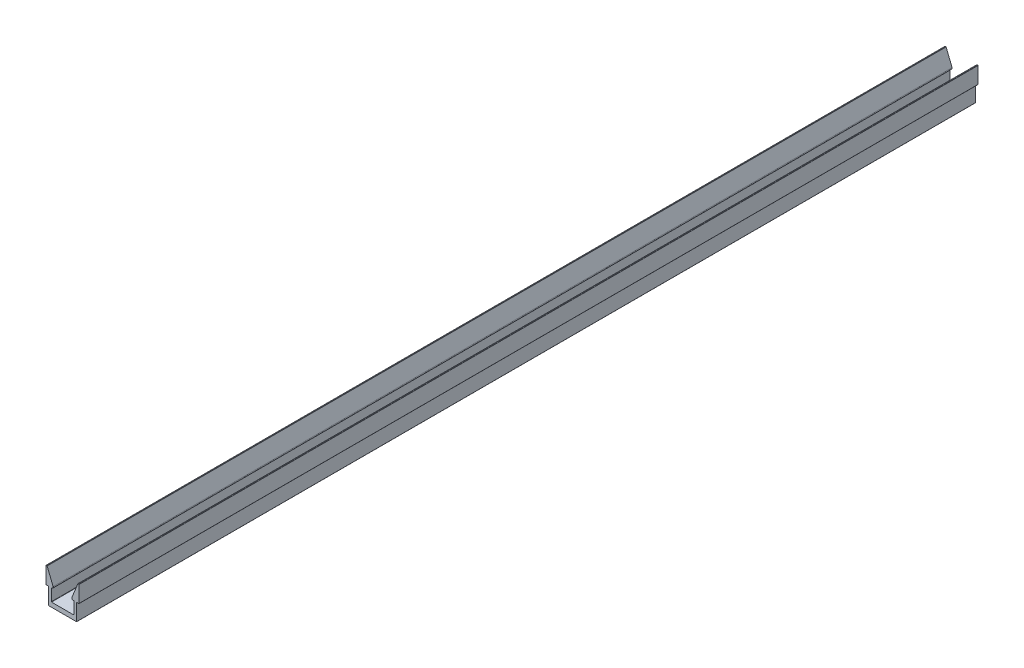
ISO-10303-21;
HEADER;
FILE_DESCRIPTION(('STEP AP214'),'2;1');
FILE_NAME('part.step','',(''),(''),'','','');
FILE_SCHEMA(('AUTOMOTIVE_DESIGN { 1 0 10303 214 1 1 1 1 }'));
ENDSEC;
DATA;
#1=APPLICATION_CONTEXT('core data for automotive mechanical design processes');
#2=APPLICATION_PROTOCOL_DEFINITION('international standard','automotive_design',2000,#1);
#3=PRODUCT_CONTEXT('',#1,'mechanical');
#4=PRODUCT('Part','Part','',(#3));
#5=PRODUCT_RELATED_PRODUCT_CATEGORY('part','',(#4));
#6=PRODUCT_DEFINITION_FORMATION('','',#4);
#7=PRODUCT_DEFINITION_CONTEXT('part definition',#1,'design');
#8=PRODUCT_DEFINITION('design','',#6,#7);
#9=PRODUCT_DEFINITION_SHAPE('','',#8);
#10=(LENGTH_UNIT() NAMED_UNIT(*) SI_UNIT(.MILLI.,.METRE.));
#11=(NAMED_UNIT(*) PLANE_ANGLE_UNIT() SI_UNIT($,.RADIAN.));
#12=(NAMED_UNIT(*) SI_UNIT($,.STERADIAN.) SOLID_ANGLE_UNIT());
#13=UNCERTAINTY_MEASURE_WITH_UNIT(LENGTH_MEASURE(1.E-05),#10,'distance_accuracy_value','');
#14=(GEOMETRIC_REPRESENTATION_CONTEXT(3) GLOBAL_UNCERTAINTY_ASSIGNED_CONTEXT((#13)) GLOBAL_UNIT_ASSIGNED_CONTEXT((#10,
#11,#12)) REPRESENTATION_CONTEXT('',''));
#15=CARTESIAN_POINT('',(0.,0.,0.));
#16=DIRECTION('',(0.,0.,1.));
#17=DIRECTION('',(1.,0.,0.));
#18=AXIS2_PLACEMENT_3D('',#15,#16,#17);
#19=CARTESIAN_POINT('',(6.35,9.525,508.));
#20=DIRECTION('',(1.,0.,0.));
#21=DIRECTION('',(0.,1.,0.));
#22=AXIS2_PLACEMENT_3D('',#19,#20,#21);
#23=PLANE('',#22);
#24=DIRECTION('',(0.,-1.,0.));
#25=VECTOR('',#24,1.);
#26=CARTESIAN_POINT('',(6.35,9.525,0.));
#27=LINE('',#26,#25);
#28=CARTESIAN_POINT('',(6.35,9.525,0.));
#29=VERTEX_POINT('',#28);
#30=CARTESIAN_POINT('',(6.35,2.667,0.));
#31=VERTEX_POINT('',#30);
#32=EDGE_CURVE('E214',#29,#31,#27,.T.);
#33=ORIENTED_EDGE('',*,*,#32,.T.);
#34=DIRECTION('',(0.,0.,-1.));
#35=VECTOR('',#34,1.);
#36=CARTESIAN_POINT('',(6.35,2.667,508.));
#37=LINE('',#36,#35);
#38=CARTESIAN_POINT('',(6.35,2.667,508.));
#39=VERTEX_POINT('',#38);
#40=EDGE_CURVE('E9',#39,#31,#37,.T.);
#41=ORIENTED_EDGE('',*,*,#40,.F.);
#42=DIRECTION('',(0.,-1.,0.));
#43=VECTOR('',#42,1.);
#44=CARTESIAN_POINT('',(6.35,9.525,508.));
#45=LINE('',#44,#43);
#46=CARTESIAN_POINT('',(6.35,9.525,508.));
#47=VERTEX_POINT('',#46);
#48=EDGE_CURVE('E285',#47,#39,#45,.T.);
#49=ORIENTED_EDGE('',*,*,#48,.F.);
#50=DIRECTION('',(0.,0.,-1.));
#51=VECTOR('',#50,1.);
#52=CARTESIAN_POINT('',(6.35,9.525,508.));
#53=LINE('',#52,#51);
#54=EDGE_CURVE('E227',#47,#29,#53,.T.);
#55=ORIENTED_EDGE('',*,*,#54,.T.);
#56=EDGE_LOOP('',(#33,#41,#49,#55));
#57=FACE_BOUND('',#56,.T.);
#58=ADVANCED_FACE('F14',(#57),#23,.F.);
#59=CARTESIAN_POINT('',(6.223,2.667,508.));
#60=DIRECTION('',(0.,0.,-1.));
#61=DIRECTION('',(-1.,0.,0.));
#62=AXIS2_PLACEMENT_3D('',#59,#60,#61);
#63=CYLINDRICAL_SURFACE('',#62,0.127);
#64=CARTESIAN_POINT('',(6.223,2.667,0.));
#65=DIRECTION('',(0.,0.,-1.));
#66=DIRECTION('',(-1.,0.,0.));
#67=AXIS2_PLACEMENT_3D('',#64,#65,#66);
#68=CIRCLE('',#67,0.127);
#69=CARTESIAN_POINT('',(6.223,2.54,0.));
#70=VERTEX_POINT('',#69);
#71=EDGE_CURVE('E210',#31,#70,#68,.T.);
#72=ORIENTED_EDGE('',*,*,#71,.T.);
#73=DIRECTION('',(0.,0.,-1.));
#74=VECTOR('',#73,1.);
#75=CARTESIAN_POINT('',(6.223,2.54,508.));
#76=LINE('',#75,#74);
#77=CARTESIAN_POINT('',(6.223,2.54,508.));
#78=VERTEX_POINT('',#77);
#79=EDGE_CURVE('E21',#78,#70,#76,.T.);
#80=ORIENTED_EDGE('',*,*,#79,.F.);
#81=CARTESIAN_POINT('',(6.223,2.667,508.));
#82=DIRECTION('',(0.,0.,-1.));
#83=DIRECTION('',(-1.,0.,0.));
#84=AXIS2_PLACEMENT_3D('',#81,#82,#83);
#85=CIRCLE('',#84,0.127);
#86=EDGE_CURVE('E223',#39,#78,#85,.T.);
#87=ORIENTED_EDGE('',*,*,#86,.F.);
#88=ORIENTED_EDGE('',*,*,#40,.T.);
#89=EDGE_LOOP('',(#72,#80,#87,#88));
#90=FACE_BOUND('',#89,.T.);
#91=ADVANCED_FACE('F222',(#90),#63,.F.);
#92=CARTESIAN_POINT('',(6.223,2.54,508.));
#93=DIRECTION('',(0.,-1.,0.));
#94=DIRECTION('',(1.,0.,0.));
#95=AXIS2_PLACEMENT_3D('',#92,#93,#94);
#96=PLANE('',#95);
#97=DIRECTION('',(-1.,0.,0.));
#98=VECTOR('',#97,1.);
#99=CARTESIAN_POINT('',(6.223,2.54,0.));
#100=LINE('',#99,#98);
#101=CARTESIAN_POINT('',(-6.223,2.54,0.));
#102=VERTEX_POINT('',#101);
#103=EDGE_CURVE('E216',#70,#102,#100,.T.);
#104=ORIENTED_EDGE('',*,*,#103,.T.);
#105=DIRECTION('',(0.,0.,-1.));
#106=VECTOR('',#105,1.);
#107=CARTESIAN_POINT('',(-6.223,2.54,508.));
#108=LINE('',#107,#106);
#109=CARTESIAN_POINT('',(-6.223,2.54,508.));
#110=VERTEX_POINT('',#109);
#111=EDGE_CURVE('E421',#110,#102,#108,.T.);
#112=ORIENTED_EDGE('',*,*,#111,.F.);
#113=DIRECTION('',(-1.,0.,0.));
#114=VECTOR('',#113,1.);
#115=CARTESIAN_POINT('',(6.223,2.54,508.));
#116=LINE('',#115,#114);
#117=EDGE_CURVE('E288',#78,#110,#116,.T.);
#118=ORIENTED_EDGE('',*,*,#117,.F.);
#119=ORIENTED_EDGE('',*,*,#79,.T.);
#120=EDGE_LOOP('',(#104,#112,#118,#119));
#121=FACE_BOUND('',#120,.T.);
#122=ADVANCED_FACE('F425',(#121),#96,.F.);
#123=CARTESIAN_POINT('',(-6.223,2.667,508.));
#124=DIRECTION('',(0.,0.,-1.));
#125=DIRECTION('',(-1.,0.,0.));
#126=AXIS2_PLACEMENT_3D('',#123,#124,#125);
#127=CYLINDRICAL_SURFACE('',#126,0.127);
#128=CARTESIAN_POINT('',(-6.223,2.667,0.));
#129=DIRECTION('',(0.,0.,-1.));
#130=DIRECTION('',(1.,0.,0.));
#131=AXIS2_PLACEMENT_3D('',#128,#129,#130);
#132=CIRCLE('',#131,0.127);
#133=CARTESIAN_POINT('',(-6.35,2.667,0.));
#134=VERTEX_POINT('',#133);
#135=EDGE_CURVE('E231',#102,#134,#132,.T.);
#136=ORIENTED_EDGE('',*,*,#135,.T.);
#137=DIRECTION('',(0.,0.,-1.));
#138=VECTOR('',#137,1.);
#139=CARTESIAN_POINT('',(-6.35,2.667,508.));
#140=LINE('',#139,#138);
#141=CARTESIAN_POINT('',(-6.35,2.667,508.));
#142=VERTEX_POINT('',#141);
#143=EDGE_CURVE('E418',#142,#134,#140,.T.);
#144=ORIENTED_EDGE('',*,*,#143,.F.);
#145=CARTESIAN_POINT('',(-6.223,2.667,508.));
#146=DIRECTION('',(0.,0.,-1.));
#147=DIRECTION('',(1.,0.,0.));
#148=AXIS2_PLACEMENT_3D('',#145,#146,#147);
#149=CIRCLE('',#148,0.127);
#150=EDGE_CURVE('E290',#110,#142,#149,.T.);
#151=ORIENTED_EDGE('',*,*,#150,.F.);
#152=ORIENTED_EDGE('',*,*,#111,.T.);
#153=EDGE_LOOP('',(#136,#144,#151,#152));
#154=FACE_BOUND('',#153,.T.);
#155=ADVANCED_FACE('F433',(#154),#127,.F.);
#156=CARTESIAN_POINT('',(-6.35,9.525,508.));
#157=DIRECTION('',(-1.,0.,0.));
#158=DIRECTION('',(0.,-1.,0.));
#159=AXIS2_PLACEMENT_3D('',#156,#157,#158);
#160=PLANE('',#159);
#161=DIRECTION('',(0.,1.,0.));
#162=VECTOR('',#161,1.);
#163=CARTESIAN_POINT('',(-6.35,9.525,0.));
#164=LINE('',#163,#162);
#165=CARTESIAN_POINT('',(-6.35,9.525,0.));
#166=VERTEX_POINT('',#165);
#167=EDGE_CURVE('E233',#134,#166,#164,.T.);
#168=ORIENTED_EDGE('',*,*,#167,.T.);
#169=DIRECTION('',(0.,0.,-1.));
#170=VECTOR('',#169,1.);
#171=CARTESIAN_POINT('',(-6.35,9.525,508.));
#172=LINE('',#171,#170);
#173=CARTESIAN_POINT('',(-6.35,9.525,508.));
#174=VERTEX_POINT('',#173);
#175=EDGE_CURVE('E415',#174,#166,#172,.T.);
#176=ORIENTED_EDGE('',*,*,#175,.F.);
#177=DIRECTION('',(0.,1.,0.));
#178=VECTOR('',#177,1.);
#179=CARTESIAN_POINT('',(-6.35,9.525,508.));
#180=LINE('',#179,#178);
#181=EDGE_CURVE('E292',#142,#174,#180,.T.);
#182=ORIENTED_EDGE('',*,*,#181,.F.);
#183=ORIENTED_EDGE('',*,*,#143,.T.);
#184=EDGE_LOOP('',(#168,#176,#182,#183));
#185=FACE_BOUND('',#184,.T.);
#186=ADVANCED_FACE('F436',(#185),#160,.F.);
#187=CARTESIAN_POINT('',(-6.00626165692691,9.525,508.));
#188=DIRECTION('',(0.,1.,0.));
#189=DIRECTION('',(0.,0.,1.));
#190=AXIS2_PLACEMENT_3D('',#187,#188,#189);
#191=PLANE('',#190);
#192=DIRECTION('',(1.,0.,0.));
#193=VECTOR('',#192,1.);
#194=CARTESIAN_POINT('',(-6.00626165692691,9.525,0.));
#195=LINE('',#194,#193);
#196=CARTESIAN_POINT('',(-6.00626165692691,9.525,0.));
#197=VERTEX_POINT('',#196);
#198=EDGE_CURVE('E235',#166,#197,#195,.T.);
#199=ORIENTED_EDGE('',*,*,#198,.T.);
#200=DIRECTION('',(0.,0.,-1.));
#201=VECTOR('',#200,1.);
#202=CARTESIAN_POINT('',(-6.00626165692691,9.525,508.));
#203=LINE('',#202,#201);
#204=CARTESIAN_POINT('',(-6.00626165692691,9.525,508.));
#205=VERTEX_POINT('',#204);
#206=EDGE_CURVE('E412',#205,#197,#203,.T.);
#207=ORIENTED_EDGE('',*,*,#206,.F.);
#208=DIRECTION('',(1.,0.,0.));
#209=VECTOR('',#208,1.);
#210=CARTESIAN_POINT('',(-6.00626165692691,9.525,508.));
#211=LINE('',#210,#209);
#212=EDGE_CURVE('E294',#174,#205,#211,.T.);
#213=ORIENTED_EDGE('',*,*,#212,.F.);
#214=ORIENTED_EDGE('',*,*,#175,.T.);
#215=EDGE_LOOP('',(#199,#207,#213,#214));
#216=FACE_BOUND('',#215,.T.);
#217=ADVANCED_FACE('F441',(#216),#191,.F.);
#218=CARTESIAN_POINT('',(-6.00626165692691,10.287,508.));
#219=DIRECTION('',(0.,0.,-1.));
#220=DIRECTION('',(-1.,0.,0.));
#221=AXIS2_PLACEMENT_3D('',#218,#219,#220);
#222=CYLINDRICAL_SURFACE('',#221,0.762);
#223=CARTESIAN_POINT('',(-6.00626165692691,10.287,0.));
#224=DIRECTION('',(0.,0.,1.));
#225=DIRECTION('',(-1.,0.,0.));
#226=AXIS2_PLACEMENT_3D('',#223,#224,#225);
#227=CIRCLE('',#226,0.762);
#228=CARTESIAN_POINT('',(-5.29974755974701,10.5724502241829,0.));
#229=VERTEX_POINT('',#228);
#230=EDGE_CURVE('E237',#197,#229,#227,.T.);
#231=ORIENTED_EDGE('',*,*,#230,.T.);
#232=DIRECTION('',(0.,0.,-1.));
#233=VECTOR('',#232,1.);
#234=CARTESIAN_POINT('',(-5.29974755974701,10.5724502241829,508.));
#235=LINE('',#234,#233);
#236=CARTESIAN_POINT('',(-5.29974755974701,10.5724502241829,508.));
#237=VERTEX_POINT('',#236);
#238=EDGE_CURVE('E409',#237,#229,#235,.T.);
#239=ORIENTED_EDGE('',*,*,#238,.F.);
#240=CARTESIAN_POINT('',(-6.00626165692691,10.287,508.));
#241=DIRECTION('',(0.,0.,1.));
#242=DIRECTION('',(-1.,0.,0.));
#243=AXIS2_PLACEMENT_3D('',#240,#241,#242);
#244=CIRCLE('',#243,0.762);
#245=EDGE_CURVE('E296',#205,#237,#244,.T.);
#246=ORIENTED_EDGE('',*,*,#245,.F.);
#247=ORIENTED_EDGE('',*,*,#206,.T.);
#248=EDGE_LOOP('',(#231,#239,#246,#247));
#249=FACE_BOUND('',#248,.T.);
#250=ADVANCED_FACE('F447',(#249),#222,.T.);
#251=CARTESIAN_POINT('',(-8.69281023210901,18.9705750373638,508.));
#252=DIRECTION('',(-0.92718385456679,-0.374606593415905,0.));
#253=DIRECTION('',(0.374606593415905,-0.92718385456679,0.));
#254=AXIS2_PLACEMENT_3D('',#251,#252,#253);
#255=PLANE('',#254);
#256=DIRECTION('',(-0.374606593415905,0.92718385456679,0.));
#257=VECTOR('',#256,1.);
#258=CARTESIAN_POINT('',(-8.69281023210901,18.9705750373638,0.));
#259=LINE('',#258,#257);
#260=CARTESIAN_POINT('',(-8.69281023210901,18.9705750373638,0.));
#261=VERTEX_POINT('',#260);
#262=EDGE_CURVE('E239',#229,#261,#259,.T.);
#263=ORIENTED_EDGE('',*,*,#262,.T.);
#264=DIRECTION('',(0.,0.,-1.));
#265=VECTOR('',#264,1.);
#266=CARTESIAN_POINT('',(-8.69281023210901,18.9705750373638,508.));
#267=LINE('',#266,#265);
#268=CARTESIAN_POINT('',(-8.69281023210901,18.9705750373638,508.));
#269=VERTEX_POINT('',#268);
#270=EDGE_CURVE('E406',#269,#261,#267,.T.);
#271=ORIENTED_EDGE('',*,*,#270,.F.);
#272=DIRECTION('',(-0.374606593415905,0.92718385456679,0.));
#273=VECTOR('',#272,1.);
#274=CARTESIAN_POINT('',(-8.69281023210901,18.9705750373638,508.));
#275=LINE('',#274,#273);
#276=EDGE_CURVE('E298',#237,#269,#275,.T.);
#277=ORIENTED_EDGE('',*,*,#276,.F.);
#278=ORIENTED_EDGE('',*,*,#238,.T.);
#279=EDGE_LOOP('',(#263,#271,#277,#278));
#280=FACE_BOUND('',#279,.T.);
#281=ADVANCED_FACE('F451',(#280),#255,.F.);
#282=CARTESIAN_POINT('',(-8.81056258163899,18.923,508.));
#283=DIRECTION('',(0.,0.,-1.));
#284=DIRECTION('',(-1.,0.,0.));
#285=AXIS2_PLACEMENT_3D('',#282,#283,#284);
#286=CYLINDRICAL_SURFACE('',#285,0.126999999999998);
#287=CARTESIAN_POINT('',(-8.81056258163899,18.923,0.));
#288=DIRECTION('',(0.,0.,1.));
#289=DIRECTION('',(-1.,0.,0.));
#290=AXIS2_PLACEMENT_3D('',#287,#288,#289);
#291=CIRCLE('',#290,0.126999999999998);
#292=CARTESIAN_POINT('',(-8.81056258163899,19.05,0.));
#293=VERTEX_POINT('',#292);
#294=EDGE_CURVE('E241',#261,#293,#291,.T.);
#295=ORIENTED_EDGE('',*,*,#294,.T.);
#296=DIRECTION('',(0.,0.,-1.));
#297=VECTOR('',#296,1.);
#298=CARTESIAN_POINT('',(-8.81056258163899,19.05,508.));
#299=LINE('',#298,#297);
#300=CARTESIAN_POINT('',(-8.81056258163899,19.05,508.));
#301=VERTEX_POINT('',#300);
#302=EDGE_CURVE('E403',#301,#293,#299,.T.);
#303=ORIENTED_EDGE('',*,*,#302,.F.);
#304=CARTESIAN_POINT('',(-8.81056258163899,18.923,508.));
#305=DIRECTION('',(0.,0.,1.));
#306=DIRECTION('',(-1.,0.,0.));
#307=AXIS2_PLACEMENT_3D('',#304,#305,#306);
#308=CIRCLE('',#307,0.126999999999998);
#309=EDGE_CURVE('E300',#269,#301,#308,.T.);
#310=ORIENTED_EDGE('',*,*,#309,.F.);
#311=ORIENTED_EDGE('',*,*,#270,.T.);
#312=EDGE_LOOP('',(#295,#303,#310,#311));
#313=FACE_BOUND('',#312,.T.);
#314=ADVANCED_FACE('F456',(#313),#286,.T.);
#315=CARTESIAN_POINT('',(-9.2075,19.05,508.));
#316=DIRECTION('',(0.,-1.,0.));
#317=DIRECTION('',(0.,0.,-1.));
#318=AXIS2_PLACEMENT_3D('',#315,#316,#317);
#319=PLANE('',#318);
#320=DIRECTION('',(-1.,0.,0.));
#321=VECTOR('',#320,1.);
#322=CARTESIAN_POINT('',(-9.2075,19.05,0.));
#323=LINE('',#322,#321);
#324=CARTESIAN_POINT('',(-9.2075,19.05,0.));
#325=VERTEX_POINT('',#324);
#326=EDGE_CURVE('E243',#293,#325,#323,.T.);
#327=ORIENTED_EDGE('',*,*,#326,.T.);
#328=DIRECTION('',(0.,0.,-1.));
#329=VECTOR('',#328,1.);
#330=CARTESIAN_POINT('',(-9.2075,19.05,508.));
#331=LINE('',#330,#329);
#332=CARTESIAN_POINT('',(-9.2075,19.05,508.));
#333=VERTEX_POINT('',#332);
#334=EDGE_CURVE('E400',#333,#325,#331,.T.);
#335=ORIENTED_EDGE('',*,*,#334,.F.);
#336=DIRECTION('',(-1.,0.,0.));
#337=VECTOR('',#336,1.);
#338=CARTESIAN_POINT('',(-9.2075,19.05,508.));
#339=LINE('',#338,#337);
#340=EDGE_CURVE('E302',#301,#333,#339,.T.);
#341=ORIENTED_EDGE('',*,*,#340,.F.);
#342=ORIENTED_EDGE('',*,*,#302,.T.);
#343=EDGE_LOOP('',(#327,#335,#341,#342));
#344=FACE_BOUND('',#343,.T.);
#345=ADVANCED_FACE('F462',(#344),#319,.F.);
#346=CARTESIAN_POINT('',(-9.2075,18.923,508.));
#347=DIRECTION('',(0.,0.,-1.));
#348=DIRECTION('',(-1.,0.,0.));
#349=AXIS2_PLACEMENT_3D('',#346,#347,#348);
#350=CYLINDRICAL_SURFACE('',#349,0.126999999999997);
#351=CARTESIAN_POINT('',(-9.2075,18.923,0.));
#352=DIRECTION('',(0.,0.,1.));
#353=DIRECTION('',(-1.,0.,0.));
#354=AXIS2_PLACEMENT_3D('',#351,#352,#353);
#355=CIRCLE('',#354,0.126999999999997);
#356=CARTESIAN_POINT('',(-9.3345,18.923,0.));
#357=VERTEX_POINT('',#356);
#358=EDGE_CURVE('E245',#325,#357,#355,.T.);
#359=ORIENTED_EDGE('',*,*,#358,.T.);
#360=DIRECTION('',(0.,0.,-1.));
#361=VECTOR('',#360,1.);
#362=CARTESIAN_POINT('',(-9.3345,18.923,508.));
#363=LINE('',#362,#361);
#364=CARTESIAN_POINT('',(-9.3345,18.923,508.));
#365=VERTEX_POINT('',#364);
#366=EDGE_CURVE('E397',#365,#357,#363,.T.);
#367=ORIENTED_EDGE('',*,*,#366,.F.);
#368=CARTESIAN_POINT('',(-9.2075,18.923,508.));
#369=DIRECTION('',(0.,0.,1.));
#370=DIRECTION('',(-1.,0.,0.));
#371=AXIS2_PLACEMENT_3D('',#368,#369,#370);
#372=CIRCLE('',#371,0.126999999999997);
#373=EDGE_CURVE('E304',#333,#365,#372,.T.);
#374=ORIENTED_EDGE('',*,*,#373,.F.);
#375=ORIENTED_EDGE('',*,*,#334,.T.);
#376=EDGE_LOOP('',(#359,#367,#374,#375));
#377=FACE_BOUND('',#376,.T.);
#378=ADVANCED_FACE('F466',(#377),#350,.T.);
#379=CARTESIAN_POINT('',(-9.3345,9.652,508.));
#380=DIRECTION('',(1.,0.,0.));
#381=DIRECTION('',(0.,1.,0.));
#382=AXIS2_PLACEMENT_3D('',#379,#380,#381);
#383=PLANE('',#382);
#384=DIRECTION('',(0.,-1.,0.));
#385=VECTOR('',#384,1.);
#386=CARTESIAN_POINT('',(-9.3345,9.652,0.));
#387=LINE('',#386,#385);
#388=CARTESIAN_POINT('',(-9.3345,9.652,0.));
#389=VERTEX_POINT('',#388);
#390=EDGE_CURVE('E247',#357,#389,#387,.T.);
#391=ORIENTED_EDGE('',*,*,#390,.T.);
#392=DIRECTION('',(0.,0.,-1.));
#393=VECTOR('',#392,1.);
#394=CARTESIAN_POINT('',(-9.3345,9.652,508.));
#395=LINE('',#394,#393);
#396=CARTESIAN_POINT('',(-9.3345,9.652,508.));
#397=VERTEX_POINT('',#396);
#398=EDGE_CURVE('E394',#397,#389,#395,.T.);
#399=ORIENTED_EDGE('',*,*,#398,.F.);
#400=DIRECTION('',(0.,-1.,0.));
#401=VECTOR('',#400,1.);
#402=CARTESIAN_POINT('',(-9.3345,9.652,508.));
#403=LINE('',#402,#401);
#404=EDGE_CURVE('E306',#365,#397,#403,.T.);
#405=ORIENTED_EDGE('',*,*,#404,.F.);
#406=ORIENTED_EDGE('',*,*,#366,.T.);
#407=EDGE_LOOP('',(#391,#399,#405,#406));
#408=FACE_BOUND('',#407,.T.);
#409=ADVANCED_FACE('F471',(#408),#383,.F.);
#410=CARTESIAN_POINT('',(-9.2075,9.652,508.));
#411=DIRECTION('',(0.,0.,-1.));
#412=DIRECTION('',(-1.,0.,0.));
#413=AXIS2_PLACEMENT_3D('',#410,#411,#412);
#414=CYLINDRICAL_SURFACE('',#413,0.127);
#415=CARTESIAN_POINT('',(-9.2075,9.652,0.));
#416=DIRECTION('',(0.,0.,1.));
#417=DIRECTION('',(-1.,0.,0.));
#418=AXIS2_PLACEMENT_3D('',#415,#416,#417);
#419=CIRCLE('',#418,0.127);
#420=CARTESIAN_POINT('',(-9.2075,9.525,0.));
#421=VERTEX_POINT('',#420);
#422=EDGE_CURVE('E249',#389,#421,#419,.T.);
#423=ORIENTED_EDGE('',*,*,#422,.T.);
#424=DIRECTION('',(0.,0.,-1.));
#425=VECTOR('',#424,1.);
#426=CARTESIAN_POINT('',(-9.2075,9.525,508.));
#427=LINE('',#426,#425);
#428=CARTESIAN_POINT('',(-9.2075,9.525,508.));
#429=VERTEX_POINT('',#428);
#430=EDGE_CURVE('E391',#429,#421,#427,.T.);
#431=ORIENTED_EDGE('',*,*,#430,.F.);
#432=CARTESIAN_POINT('',(-9.2075,9.652,508.));
#433=DIRECTION('',(0.,0.,1.));
#434=DIRECTION('',(-1.,0.,0.));
#435=AXIS2_PLACEMENT_3D('',#432,#433,#434);
#436=CIRCLE('',#435,0.127);
#437=EDGE_CURVE('E308',#397,#429,#436,.T.);
#438=ORIENTED_EDGE('',*,*,#437,.F.);
#439=ORIENTED_EDGE('',*,*,#398,.T.);
#440=EDGE_LOOP('',(#423,#431,#438,#439));
#441=FACE_BOUND('',#440,.T.);
#442=ADVANCED_FACE('F477',(#441),#414,.T.);
#443=CARTESIAN_POINT('',(-8.1534,9.525,508.));
#444=DIRECTION('',(0.,1.,0.));
#445=DIRECTION('',(0.,0.,1.));
#446=AXIS2_PLACEMENT_3D('',#443,#444,#445);
#447=PLANE('',#446);
#448=DIRECTION('',(1.,0.,0.));
#449=VECTOR('',#448,1.);
#450=CARTESIAN_POINT('',(-8.1534,9.525,0.));
#451=LINE('',#450,#449);
#452=CARTESIAN_POINT('',(-8.1534,9.525,0.));
#453=VERTEX_POINT('',#452);
#454=EDGE_CURVE('E251',#421,#453,#451,.T.);
#455=ORIENTED_EDGE('',*,*,#454,.T.);
#456=DIRECTION('',(0.,0.,-1.));
#457=VECTOR('',#456,1.);
#458=CARTESIAN_POINT('',(-8.1534,9.525,508.));
#459=LINE('',#458,#457);
#460=CARTESIAN_POINT('',(-8.1534,9.525,508.));
#461=VERTEX_POINT('',#460);
#462=EDGE_CURVE('E388',#461,#453,#459,.T.);
#463=ORIENTED_EDGE('',*,*,#462,.F.);
#464=DIRECTION('',(1.,0.,0.));
#465=VECTOR('',#464,1.);
#466=CARTESIAN_POINT('',(-8.1534,9.525,508.));
#467=LINE('',#466,#465);
#468=EDGE_CURVE('E310',#429,#461,#467,.T.);
#469=ORIENTED_EDGE('',*,*,#468,.F.);
#470=ORIENTED_EDGE('',*,*,#430,.T.);
#471=EDGE_LOOP('',(#455,#463,#469,#470));
#472=FACE_BOUND('',#471,.T.);
#473=ADVANCED_FACE('F481',(#472),#447,.F.);
#474=CARTESIAN_POINT('',(-8.1534,9.398,508.));
#475=DIRECTION('',(0.,0.,-1.));
#476=DIRECTION('',(-1.,0.,0.));
#477=AXIS2_PLACEMENT_3D('',#474,#475,#476);
#478=CYLINDRICAL_SURFACE('',#477,0.127);
#479=CARTESIAN_POINT('',(-8.1534,9.398,0.));
#480=DIRECTION('',(0.,0.,-1.));
#481=DIRECTION('',(1.,0.,0.));
#482=AXIS2_PLACEMENT_3D('',#479,#480,#481);
#483=CIRCLE('',#482,0.127);
#484=CARTESIAN_POINT('',(-8.0264,9.398,0.));
#485=VERTEX_POINT('',#484);
#486=EDGE_CURVE('E253',#453,#485,#483,.T.);
#487=ORIENTED_EDGE('',*,*,#486,.T.);
#488=DIRECTION('',(0.,0.,-1.));
#489=VECTOR('',#488,1.);
#490=CARTESIAN_POINT('',(-8.0264,9.398,508.));
#491=LINE('',#490,#489);
#492=CARTESIAN_POINT('',(-8.0264,9.398,508.));
#493=VERTEX_POINT('',#492);
#494=EDGE_CURVE('E385',#493,#485,#491,.T.);
#495=ORIENTED_EDGE('',*,*,#494,.F.);
#496=CARTESIAN_POINT('',(-8.1534,9.398,508.));
#497=DIRECTION('',(0.,0.,-1.));
#498=DIRECTION('',(1.,0.,0.));
#499=AXIS2_PLACEMENT_3D('',#496,#497,#498);
#500=CIRCLE('',#499,0.127);
#501=EDGE_CURVE('E312',#461,#493,#500,.T.);
#502=ORIENTED_EDGE('',*,*,#501,.F.);
#503=ORIENTED_EDGE('',*,*,#462,.T.);
#504=EDGE_LOOP('',(#487,#495,#502,#503));
#505=FACE_BOUND('',#504,.T.);
#506=ADVANCED_FACE('F486',(#505),#478,.F.);
#507=CARTESIAN_POINT('',(-8.0264,0.127,508.));
#508=DIRECTION('',(1.,0.,0.));
#509=DIRECTION('',(0.,0.,-1.));
#510=AXIS2_PLACEMENT_3D('',#507,#508,#509);
#511=PLANE('',#510);
#512=DIRECTION('',(0.,-1.,0.));
#513=VECTOR('',#512,1.);
#514=CARTESIAN_POINT('',(-8.0264,0.127,0.));
#515=LINE('',#514,#513);
#516=CARTESIAN_POINT('',(-8.0264,0.127,0.));
#517=VERTEX_POINT('',#516);
#518=EDGE_CURVE('E255',#485,#517,#515,.T.);
#519=ORIENTED_EDGE('',*,*,#518,.T.);
#520=DIRECTION('',(0.,0.,-1.));
#521=VECTOR('',#520,1.);
#522=CARTESIAN_POINT('',(-8.0264,0.127,508.));
#523=LINE('',#522,#521);
#524=CARTESIAN_POINT('',(-8.0264,0.127,508.));
#525=VERTEX_POINT('',#524);
#526=EDGE_CURVE('E382',#525,#517,#523,.T.);
#527=ORIENTED_EDGE('',*,*,#526,.F.);
#528=DIRECTION('',(0.,-1.,0.));
#529=VECTOR('',#528,1.);
#530=CARTESIAN_POINT('',(-8.0264,0.127,508.));
#531=LINE('',#530,#529);
#532=EDGE_CURVE('E314',#493,#525,#531,.T.);
#533=ORIENTED_EDGE('',*,*,#532,.F.);
#534=ORIENTED_EDGE('',*,*,#494,.T.);
#535=EDGE_LOOP('',(#519,#527,#533,#534));
#536=FACE_BOUND('',#535,.T.);
#537=ADVANCED_FACE('F492',(#536),#511,.F.);
#538=CARTESIAN_POINT('',(-7.8994,0.127,508.));
#539=DIRECTION('',(0.,0.,-1.));
#540=DIRECTION('',(-1.,0.,0.));
#541=AXIS2_PLACEMENT_3D('',#538,#539,#540);
#542=CYLINDRICAL_SURFACE('',#541,0.127);
#543=CARTESIAN_POINT('',(-7.8994,0.127,0.));
#544=DIRECTION('',(0.,0.,1.));
#545=DIRECTION('',(-1.,0.,0.));
#546=AXIS2_PLACEMENT_3D('',#543,#544,#545);
#547=CIRCLE('',#546,0.127);
#548=CARTESIAN_POINT('',(-7.8994,0.,0.));
#549=VERTEX_POINT('',#548);
#550=EDGE_CURVE('E257',#517,#549,#547,.T.);
#551=ORIENTED_EDGE('',*,*,#550,.T.);
#552=DIRECTION('',(0.,0.,-1.));
#553=VECTOR('',#552,1.);
#554=CARTESIAN_POINT('',(-7.8994,0.,508.));
#555=LINE('',#554,#553);
#556=CARTESIAN_POINT('',(-7.8994,0.,508.));
#557=VERTEX_POINT('',#556);
#558=EDGE_CURVE('E379',#557,#549,#555,.T.);
#559=ORIENTED_EDGE('',*,*,#558,.F.);
#560=CARTESIAN_POINT('',(-7.8994,0.127,508.));
#561=DIRECTION('',(0.,0.,1.));
#562=DIRECTION('',(-1.,0.,0.));
#563=AXIS2_PLACEMENT_3D('',#560,#561,#562);
#564=CIRCLE('',#563,0.127);
#565=EDGE_CURVE('E316',#525,#557,#564,.T.);
#566=ORIENTED_EDGE('',*,*,#565,.F.);
#567=ORIENTED_EDGE('',*,*,#526,.T.);
#568=EDGE_LOOP('',(#551,#559,#566,#567));
#569=FACE_BOUND('',#568,.T.);
#570=ADVANCED_FACE('F496',(#569),#542,.T.);
#571=CARTESIAN_POINT('',(-7.8994,0.,508.));
#572=DIRECTION('',(0.,1.,0.));
#573=DIRECTION('',(0.,0.,1.));
#574=AXIS2_PLACEMENT_3D('',#571,#572,#573);
#575=PLANE('',#574);
#576=DIRECTION('',(1.,0.,0.));
#577=VECTOR('',#576,1.);
#578=CARTESIAN_POINT('',(-7.8994,0.,0.));
#579=LINE('',#578,#577);
#580=CARTESIAN_POINT('',(7.8994,0.,0.));
#581=VERTEX_POINT('',#580);
#582=EDGE_CURVE('E259',#549,#581,#579,.T.);
#583=ORIENTED_EDGE('',*,*,#582,.T.);
#584=DIRECTION('',(0.,0.,-1.));
#585=VECTOR('',#584,1.);
#586=CARTESIAN_POINT('',(7.8994,0.,508.));
#587=LINE('',#586,#585);
#588=CARTESIAN_POINT('',(7.8994,0.,508.));
#589=VERTEX_POINT('',#588);
#590=EDGE_CURVE('E376',#589,#581,#587,.T.);
#591=ORIENTED_EDGE('',*,*,#590,.F.);
#592=DIRECTION('',(1.,0.,0.));
#593=VECTOR('',#592,1.);
#594=CARTESIAN_POINT('',(-7.8994,0.,508.));
#595=LINE('',#594,#593);
#596=EDGE_CURVE('E318',#557,#589,#595,.T.);
#597=ORIENTED_EDGE('',*,*,#596,.F.);
#598=ORIENTED_EDGE('',*,*,#558,.T.);
#599=EDGE_LOOP('',(#583,#591,#597,#598));
#600=FACE_BOUND('',#599,.T.);
#601=ADVANCED_FACE('F501',(#600),#575,.F.);
#602=CARTESIAN_POINT('',(7.8994,0.127,508.));
#603=DIRECTION('',(0.,0.,-1.));
#604=DIRECTION('',(-1.,0.,0.));
#605=AXIS2_PLACEMENT_3D('',#602,#603,#604);
#606=CYLINDRICAL_SURFACE('',#605,0.127);
#607=CARTESIAN_POINT('',(7.8994,0.127,0.));
#608=DIRECTION('',(0.,0.,1.));
#609=DIRECTION('',(1.,0.,0.));
#610=AXIS2_PLACEMENT_3D('',#607,#608,#609);
#611=CIRCLE('',#610,0.127);
#612=CARTESIAN_POINT('',(8.0264,0.127,0.));
#613=VERTEX_POINT('',#612);
#614=EDGE_CURVE('E261',#581,#613,#611,.T.);
#615=ORIENTED_EDGE('',*,*,#614,.T.);
#616=DIRECTION('',(0.,0.,-1.));
#617=VECTOR('',#616,1.);
#618=CARTESIAN_POINT('',(8.0264,0.127,508.));
#619=LINE('',#618,#617);
#620=CARTESIAN_POINT('',(8.0264,0.127,508.));
#621=VERTEX_POINT('',#620);
#622=EDGE_CURVE('E373',#621,#613,#619,.T.);
#623=ORIENTED_EDGE('',*,*,#622,.F.);
#624=CARTESIAN_POINT('',(7.8994,0.127,508.));
#625=DIRECTION('',(0.,0.,1.));
#626=DIRECTION('',(1.,0.,0.));
#627=AXIS2_PLACEMENT_3D('',#624,#625,#626);
#628=CIRCLE('',#627,0.127);
#629=EDGE_CURVE('E320',#589,#621,#628,.T.);
#630=ORIENTED_EDGE('',*,*,#629,.F.);
#631=ORIENTED_EDGE('',*,*,#590,.T.);
#632=EDGE_LOOP('',(#615,#623,#630,#631));
#633=FACE_BOUND('',#632,.T.);
#634=ADVANCED_FACE('F507',(#633),#606,.T.);
#635=CARTESIAN_POINT('',(8.0264,0.127,508.));
#636=DIRECTION('',(-1.,0.,0.));
#637=DIRECTION('',(0.,0.,1.));
#638=AXIS2_PLACEMENT_3D('',#635,#636,#637);
#639=PLANE('',#638);
#640=DIRECTION('',(0.,1.,0.));
#641=VECTOR('',#640,1.);
#642=CARTESIAN_POINT('',(8.0264,0.127,0.));
#643=LINE('',#642,#641);
#644=CARTESIAN_POINT('',(8.0264,9.398,0.));
#645=VERTEX_POINT('',#644);
#646=EDGE_CURVE('E263',#613,#645,#643,.T.);
#647=ORIENTED_EDGE('',*,*,#646,.T.);
#648=DIRECTION('',(0.,0.,-1.));
#649=VECTOR('',#648,1.);
#650=CARTESIAN_POINT('',(8.0264,9.398,508.));
#651=LINE('',#650,#649);
#652=CARTESIAN_POINT('',(8.0264,9.398,508.));
#653=VERTEX_POINT('',#652);
#654=EDGE_CURVE('E370',#653,#645,#651,.T.);
#655=ORIENTED_EDGE('',*,*,#654,.F.);
#656=DIRECTION('',(0.,1.,0.));
#657=VECTOR('',#656,1.);
#658=CARTESIAN_POINT('',(8.0264,0.127,508.));
#659=LINE('',#658,#657);
#660=EDGE_CURVE('E322',#621,#653,#659,.T.);
#661=ORIENTED_EDGE('',*,*,#660,.F.);
#662=ORIENTED_EDGE('',*,*,#622,.T.);
#663=EDGE_LOOP('',(#647,#655,#661,#662));
#664=FACE_BOUND('',#663,.T.);
#665=ADVANCED_FACE('F511',(#664),#639,.F.);
#666=CARTESIAN_POINT('',(8.1534,9.398,508.));
#667=DIRECTION('',(0.,0.,-1.));
#668=DIRECTION('',(-1.,0.,0.));
#669=AXIS2_PLACEMENT_3D('',#666,#667,#668);
#670=CYLINDRICAL_SURFACE('',#669,0.127);
#671=CARTESIAN_POINT('',(8.1534,9.398,0.));
#672=DIRECTION('',(0.,0.,-1.));
#673=DIRECTION('',(-1.,0.,0.));
#674=AXIS2_PLACEMENT_3D('',#671,#672,#673);
#675=CIRCLE('',#674,0.127);
#676=CARTESIAN_POINT('',(8.1534,9.525,0.));
#677=VERTEX_POINT('',#676);
#678=EDGE_CURVE('E265',#645,#677,#675,.T.);
#679=ORIENTED_EDGE('',*,*,#678,.T.);
#680=DIRECTION('',(0.,0.,-1.));
#681=VECTOR('',#680,1.);
#682=CARTESIAN_POINT('',(8.1534,9.525,508.));
#683=LINE('',#682,#681);
#684=CARTESIAN_POINT('',(8.1534,9.525,508.));
#685=VERTEX_POINT('',#684);
#686=EDGE_CURVE('E367',#685,#677,#683,.T.);
#687=ORIENTED_EDGE('',*,*,#686,.F.);
#688=CARTESIAN_POINT('',(8.1534,9.398,508.));
#689=DIRECTION('',(0.,0.,-1.));
#690=DIRECTION('',(-1.,0.,0.));
#691=AXIS2_PLACEMENT_3D('',#688,#689,#690);
#692=CIRCLE('',#691,0.127);
#693=EDGE_CURVE('E324',#653,#685,#692,.T.);
#694=ORIENTED_EDGE('',*,*,#693,.F.);
#695=ORIENTED_EDGE('',*,*,#654,.T.);
#696=EDGE_LOOP('',(#679,#687,#694,#695));
#697=FACE_BOUND('',#696,.T.);
#698=ADVANCED_FACE('F516',(#697),#670,.F.);
#699=CARTESIAN_POINT('',(8.1534,9.525,508.));
#700=DIRECTION('',(0.,1.,0.));
#701=DIRECTION('',(0.,0.,1.));
#702=AXIS2_PLACEMENT_3D('',#699,#700,#701);
#703=PLANE('',#702);
#704=DIRECTION('',(1.,0.,0.));
#705=VECTOR('',#704,1.);
#706=CARTESIAN_POINT('',(8.1534,9.525,0.));
#707=LINE('',#706,#705);
#708=CARTESIAN_POINT('',(9.2075,9.525,0.));
#709=VERTEX_POINT('',#708);
#710=EDGE_CURVE('E267',#677,#709,#707,.T.);
#711=ORIENTED_EDGE('',*,*,#710,.T.);
#712=DIRECTION('',(0.,0.,-1.));
#713=VECTOR('',#712,1.);
#714=CARTESIAN_POINT('',(9.2075,9.525,508.));
#715=LINE('',#714,#713);
#716=CARTESIAN_POINT('',(9.2075,9.525,508.));
#717=VERTEX_POINT('',#716);
#718=EDGE_CURVE('E364',#717,#709,#715,.T.);
#719=ORIENTED_EDGE('',*,*,#718,.F.);
#720=DIRECTION('',(1.,0.,0.));
#721=VECTOR('',#720,1.);
#722=CARTESIAN_POINT('',(8.1534,9.525,508.));
#723=LINE('',#722,#721);
#724=EDGE_CURVE('E326',#685,#717,#723,.T.);
#725=ORIENTED_EDGE('',*,*,#724,.F.);
#726=ORIENTED_EDGE('',*,*,#686,.T.);
#727=EDGE_LOOP('',(#711,#719,#725,#726));
#728=FACE_BOUND('',#727,.T.);
#729=ADVANCED_FACE('F522',(#728),#703,.F.);
#730=CARTESIAN_POINT('',(9.2075,9.652,508.));
#731=DIRECTION('',(0.,0.,-1.));
#732=DIRECTION('',(-1.,0.,0.));
#733=AXIS2_PLACEMENT_3D('',#730,#731,#732);
#734=CYLINDRICAL_SURFACE('',#733,0.127);
#735=CARTESIAN_POINT('',(9.2075,9.652,0.));
#736=DIRECTION('',(0.,0.,1.));
#737=DIRECTION('',(1.,0.,0.));
#738=AXIS2_PLACEMENT_3D('',#735,#736,#737);
#739=CIRCLE('',#738,0.127);
#740=CARTESIAN_POINT('',(9.3345,9.652,0.));
#741=VERTEX_POINT('',#740);
#742=EDGE_CURVE('E269',#709,#741,#739,.T.);
#743=ORIENTED_EDGE('',*,*,#742,.T.);
#744=DIRECTION('',(0.,0.,-1.));
#745=VECTOR('',#744,1.);
#746=CARTESIAN_POINT('',(9.3345,9.652,508.));
#747=LINE('',#746,#745);
#748=CARTESIAN_POINT('',(9.3345,9.652,508.));
#749=VERTEX_POINT('',#748);
#750=EDGE_CURVE('E361',#749,#741,#747,.T.);
#751=ORIENTED_EDGE('',*,*,#750,.F.);
#752=CARTESIAN_POINT('',(9.2075,9.652,508.));
#753=DIRECTION('',(0.,0.,1.));
#754=DIRECTION('',(1.,0.,0.));
#755=AXIS2_PLACEMENT_3D('',#752,#753,#754);
#756=CIRCLE('',#755,0.127);
#757=EDGE_CURVE('E328',#717,#749,#756,.T.);
#758=ORIENTED_EDGE('',*,*,#757,.F.);
#759=ORIENTED_EDGE('',*,*,#718,.T.);
#760=EDGE_LOOP('',(#743,#751,#758,#759));
#761=FACE_BOUND('',#760,.T.);
#762=ADVANCED_FACE('F526',(#761),#734,.T.);
#763=CARTESIAN_POINT('',(9.3345,9.652,508.));
#764=DIRECTION('',(-1.,0.,0.));
#765=DIRECTION('',(0.,-1.,0.));
#766=AXIS2_PLACEMENT_3D('',#763,#764,#765);
#767=PLANE('',#766);
#768=DIRECTION('',(0.,1.,0.));
#769=VECTOR('',#768,1.);
#770=CARTESIAN_POINT('',(9.3345,9.652,0.));
#771=LINE('',#770,#769);
#772=CARTESIAN_POINT('',(9.3345,18.923,0.));
#773=VERTEX_POINT('',#772);
#774=EDGE_CURVE('E271',#741,#773,#771,.T.);
#775=ORIENTED_EDGE('',*,*,#774,.T.);
#776=DIRECTION('',(0.,0.,-1.));
#777=VECTOR('',#776,1.);
#778=CARTESIAN_POINT('',(9.3345,18.923,508.));
#779=LINE('',#778,#777);
#780=CARTESIAN_POINT('',(9.3345,18.923,508.));
#781=VERTEX_POINT('',#780);
#782=EDGE_CURVE('E358',#781,#773,#779,.T.);
#783=ORIENTED_EDGE('',*,*,#782,.F.);
#784=DIRECTION('',(0.,1.,0.));
#785=VECTOR('',#784,1.);
#786=CARTESIAN_POINT('',(9.3345,9.652,508.));
#787=LINE('',#786,#785);
#788=EDGE_CURVE('E330',#749,#781,#787,.T.);
#789=ORIENTED_EDGE('',*,*,#788,.F.);
#790=ORIENTED_EDGE('',*,*,#750,.T.);
#791=EDGE_LOOP('',(#775,#783,#789,#790));
#792=FACE_BOUND('',#791,.T.);
#793=ADVANCED_FACE('F531',(#792),#767,.F.);
#794=CARTESIAN_POINT('',(9.2075,18.923,508.));
#795=DIRECTION('',(0.,0.,-1.));
#796=DIRECTION('',(-1.,0.,0.));
#797=AXIS2_PLACEMENT_3D('',#794,#795,#796);
#798=CYLINDRICAL_SURFACE('',#797,0.126999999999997);
#799=CARTESIAN_POINT('',(9.2075,18.923,0.));
#800=DIRECTION('',(0.,0.,1.));
#801=DIRECTION('',(1.,0.,0.));
#802=AXIS2_PLACEMENT_3D('',#799,#800,#801);
#803=CIRCLE('',#802,0.126999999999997);
#804=CARTESIAN_POINT('',(9.2075,19.05,0.));
#805=VERTEX_POINT('',#804);
#806=EDGE_CURVE('E273',#773,#805,#803,.T.);
#807=ORIENTED_EDGE('',*,*,#806,.T.);
#808=DIRECTION('',(0.,0.,-1.));
#809=VECTOR('',#808,1.);
#810=CARTESIAN_POINT('',(9.2075,19.05,508.));
#811=LINE('',#810,#809);
#812=CARTESIAN_POINT('',(9.2075,19.05,508.));
#813=VERTEX_POINT('',#812);
#814=EDGE_CURVE('E355',#813,#805,#811,.T.);
#815=ORIENTED_EDGE('',*,*,#814,.F.);
#816=CARTESIAN_POINT('',(9.2075,18.923,508.));
#817=DIRECTION('',(0.,0.,1.));
#818=DIRECTION('',(1.,0.,0.));
#819=AXIS2_PLACEMENT_3D('',#816,#817,#818);
#820=CIRCLE('',#819,0.126999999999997);
#821=EDGE_CURVE('E332',#781,#813,#820,.T.);
#822=ORIENTED_EDGE('',*,*,#821,.F.);
#823=ORIENTED_EDGE('',*,*,#782,.T.);
#824=EDGE_LOOP('',(#807,#815,#822,#823));
#825=FACE_BOUND('',#824,.T.);
#826=ADVANCED_FACE('F537',(#825),#798,.T.);
#827=CARTESIAN_POINT('',(9.2075,19.05,508.));
#828=DIRECTION('',(0.,-1.,0.));
#829=DIRECTION('',(0.,0.,-1.));
#830=AXIS2_PLACEMENT_3D('',#827,#828,#829);
#831=PLANE('',#830);
#832=DIRECTION('',(-1.,0.,0.));
#833=VECTOR('',#832,1.);
#834=CARTESIAN_POINT('',(9.2075,19.05,0.));
#835=LINE('',#834,#833);
#836=CARTESIAN_POINT('',(8.81056258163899,19.05,0.));
#837=VERTEX_POINT('',#836);
#838=EDGE_CURVE('E275',#805,#837,#835,.T.);
#839=ORIENTED_EDGE('',*,*,#838,.T.);
#840=DIRECTION('',(0.,0.,-1.));
#841=VECTOR('',#840,1.);
#842=CARTESIAN_POINT('',(8.81056258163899,19.05,508.));
#843=LINE('',#842,#841);
#844=CARTESIAN_POINT('',(8.81056258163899,19.05,508.));
#845=VERTEX_POINT('',#844);
#846=EDGE_CURVE('E352',#845,#837,#843,.T.);
#847=ORIENTED_EDGE('',*,*,#846,.F.);
#848=DIRECTION('',(-1.,0.,0.));
#849=VECTOR('',#848,1.);
#850=CARTESIAN_POINT('',(9.2075,19.05,508.));
#851=LINE('',#850,#849);
#852=EDGE_CURVE('E334',#813,#845,#851,.T.);
#853=ORIENTED_EDGE('',*,*,#852,.F.);
#854=ORIENTED_EDGE('',*,*,#814,.T.);
#855=EDGE_LOOP('',(#839,#847,#853,#854));
#856=FACE_BOUND('',#855,.T.);
#857=ADVANCED_FACE('F541',(#856),#831,.F.);
#858=CARTESIAN_POINT('',(8.81056258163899,18.923,508.));
#859=DIRECTION('',(0.,0.,-1.));
#860=DIRECTION('',(-1.,0.,0.));
#861=AXIS2_PLACEMENT_3D('',#858,#859,#860);
#862=CYLINDRICAL_SURFACE('',#861,0.126999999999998);
#863=CARTESIAN_POINT('',(8.81056258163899,18.923,0.));
#864=DIRECTION('',(0.,0.,1.));
#865=DIRECTION('',(1.,0.,0.));
#866=AXIS2_PLACEMENT_3D('',#863,#864,#865);
#867=CIRCLE('',#866,0.126999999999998);
#868=CARTESIAN_POINT('',(8.69281023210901,18.9705750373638,0.));
#869=VERTEX_POINT('',#868);
#870=EDGE_CURVE('E277',#837,#869,#867,.T.);
#871=ORIENTED_EDGE('',*,*,#870,.T.);
#872=DIRECTION('',(0.,0.,-1.));
#873=VECTOR('',#872,1.);
#874=CARTESIAN_POINT('',(8.69281023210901,18.9705750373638,508.));
#875=LINE('',#874,#873);
#876=CARTESIAN_POINT('',(8.69281023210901,18.9705750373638,508.));
#877=VERTEX_POINT('',#876);
#878=EDGE_CURVE('E349',#877,#869,#875,.T.);
#879=ORIENTED_EDGE('',*,*,#878,.F.);
#880=CARTESIAN_POINT('',(8.81056258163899,18.923,508.));
#881=DIRECTION('',(0.,0.,1.));
#882=DIRECTION('',(1.,0.,0.));
#883=AXIS2_PLACEMENT_3D('',#880,#881,#882);
#884=CIRCLE('',#883,0.126999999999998);
#885=EDGE_CURVE('E336',#845,#877,#884,.T.);
#886=ORIENTED_EDGE('',*,*,#885,.F.);
#887=ORIENTED_EDGE('',*,*,#846,.T.);
#888=EDGE_LOOP('',(#871,#879,#886,#887));
#889=FACE_BOUND('',#888,.T.);
#890=ADVANCED_FACE('F546',(#889),#862,.T.);
#891=CARTESIAN_POINT('',(8.69281023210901,18.9705750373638,508.));
#892=DIRECTION('',(0.92718385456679,-0.374606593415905,0.));
#893=DIRECTION('',(0.374606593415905,0.92718385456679,0.));
#894=AXIS2_PLACEMENT_3D('',#891,#892,#893);
#895=PLANE('',#894);
#896=DIRECTION('',(-0.374606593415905,-0.92718385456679,0.));
#897=VECTOR('',#896,1.);
#898=CARTESIAN_POINT('',(8.69281023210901,18.9705750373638,0.));
#899=LINE('',#898,#897);
#900=CARTESIAN_POINT('',(5.29974755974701,10.5724502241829,0.));
#901=VERTEX_POINT('',#900);
#902=EDGE_CURVE('E279',#869,#901,#899,.T.);
#903=ORIENTED_EDGE('',*,*,#902,.T.);
#904=DIRECTION('',(0.,0.,-1.));
#905=VECTOR('',#904,1.);
#906=CARTESIAN_POINT('',(5.29974755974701,10.5724502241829,508.));
#907=LINE('',#906,#905);
#908=CARTESIAN_POINT('',(5.29974755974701,10.5724502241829,508.));
#909=VERTEX_POINT('',#908);
#910=EDGE_CURVE('E346',#909,#901,#907,.T.);
#911=ORIENTED_EDGE('',*,*,#910,.F.);
#912=DIRECTION('',(-0.374606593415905,-0.92718385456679,0.));
#913=VECTOR('',#912,1.);
#914=CARTESIAN_POINT('',(8.69281023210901,18.9705750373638,508.));
#915=LINE('',#914,#913);
#916=EDGE_CURVE('E338',#877,#909,#915,.T.);
#917=ORIENTED_EDGE('',*,*,#916,.F.);
#918=ORIENTED_EDGE('',*,*,#878,.T.);
#919=EDGE_LOOP('',(#903,#911,#917,#918));
#920=FACE_BOUND('',#919,.T.);
#921=ADVANCED_FACE('F550',(#920),#895,.F.);
#922=CARTESIAN_POINT('',(6.00626165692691,10.287,508.));
#923=DIRECTION('',(0.,0.,-1.));
#924=DIRECTION('',(-1.,0.,0.));
#925=AXIS2_PLACEMENT_3D('',#922,#923,#924);
#926=CYLINDRICAL_SURFACE('',#925,0.762);
#927=CARTESIAN_POINT('',(6.00626165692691,10.287,0.));
#928=DIRECTION('',(0.,0.,1.));
#929=DIRECTION('',(1.,0.,0.));
#930=AXIS2_PLACEMENT_3D('',#927,#928,#929);
#931=CIRCLE('',#930,0.762);
#932=CARTESIAN_POINT('',(6.00626165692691,9.525,0.));
#933=VERTEX_POINT('',#932);
#934=EDGE_CURVE('E281',#901,#933,#931,.T.);
#935=ORIENTED_EDGE('',*,*,#934,.T.);
#936=DIRECTION('',(0.,0.,-1.));
#937=VECTOR('',#936,1.);
#938=CARTESIAN_POINT('',(6.00626165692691,9.525,508.));
#939=LINE('',#938,#937);
#940=CARTESIAN_POINT('',(6.00626165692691,9.525,508.));
#941=VERTEX_POINT('',#940);
#942=EDGE_CURVE('E343',#941,#933,#939,.T.);
#943=ORIENTED_EDGE('',*,*,#942,.F.);
#944=CARTESIAN_POINT('',(6.00626165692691,10.287,508.));
#945=DIRECTION('',(0.,0.,1.));
#946=DIRECTION('',(1.,0.,0.));
#947=AXIS2_PLACEMENT_3D('',#944,#945,#946);
#948=CIRCLE('',#947,0.762);
#949=EDGE_CURVE('E33',#909,#941,#948,.T.);
#950=ORIENTED_EDGE('',*,*,#949,.F.);
#951=ORIENTED_EDGE('',*,*,#910,.T.);
#952=EDGE_LOOP('',(#935,#943,#950,#951));
#953=FACE_BOUND('',#952,.T.);
#954=ADVANCED_FACE('F554',(#953),#926,.T.);
#955=CARTESIAN_POINT('',(6.00626165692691,9.525,508.));
#956=DIRECTION('',(0.,1.,0.));
#957=DIRECTION('',(0.,0.,1.));
#958=AXIS2_PLACEMENT_3D('',#955,#956,#957);
#959=PLANE('',#958);
#960=DIRECTION('',(1.,0.,0.));
#961=VECTOR('',#960,1.);
#962=CARTESIAN_POINT('',(6.00626165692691,9.525,0.));
#963=LINE('',#962,#961);
#964=EDGE_CURVE('E283',#933,#29,#963,.T.);
#965=ORIENTED_EDGE('',*,*,#964,.T.);
#966=ORIENTED_EDGE('',*,*,#54,.F.);
#967=DIRECTION('',(1.,0.,0.));
#968=VECTOR('',#967,1.);
#969=CARTESIAN_POINT('',(6.00626165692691,9.525,508.));
#970=LINE('',#969,#968);
#971=EDGE_CURVE('E28',#941,#47,#970,.T.);
#972=ORIENTED_EDGE('',*,*,#971,.F.);
#973=ORIENTED_EDGE('',*,*,#942,.T.);
#974=EDGE_LOOP('',(#965,#966,#972,#973));
#975=FACE_BOUND('',#974,.T.);
#976=ADVANCED_FACE('F556',(#975),#959,.F.);
#977=CARTESIAN_POINT('',(6.223,2.667,508.));
#978=DIRECTION('',(0.,0.,-1.));
#979=DIRECTION('',(-1.,0.,0.));
#980=AXIS2_PLACEMENT_3D('',#977,#978,#979);
#981=PLANE('',#980);
#982=ORIENTED_EDGE('',*,*,#48,.T.);
#983=ORIENTED_EDGE('',*,*,#86,.T.);
#984=ORIENTED_EDGE('',*,*,#117,.T.);
#985=ORIENTED_EDGE('',*,*,#150,.T.);
#986=ORIENTED_EDGE('',*,*,#181,.T.);
#987=ORIENTED_EDGE('',*,*,#212,.T.);
#988=ORIENTED_EDGE('',*,*,#245,.T.);
#989=ORIENTED_EDGE('',*,*,#276,.T.);
#990=ORIENTED_EDGE('',*,*,#309,.T.);
#991=ORIENTED_EDGE('',*,*,#340,.T.);
#992=ORIENTED_EDGE('',*,*,#373,.T.);
#993=ORIENTED_EDGE('',*,*,#404,.T.);
#994=ORIENTED_EDGE('',*,*,#437,.T.);
#995=ORIENTED_EDGE('',*,*,#468,.T.);
#996=ORIENTED_EDGE('',*,*,#501,.T.);
#997=ORIENTED_EDGE('',*,*,#532,.T.);
#998=ORIENTED_EDGE('',*,*,#565,.T.);
#999=ORIENTED_EDGE('',*,*,#596,.T.);
#1000=ORIENTED_EDGE('',*,*,#629,.T.);
#1001=ORIENTED_EDGE('',*,*,#660,.T.);
#1002=ORIENTED_EDGE('',*,*,#693,.T.);
#1003=ORIENTED_EDGE('',*,*,#724,.T.);
#1004=ORIENTED_EDGE('',*,*,#757,.T.);
#1005=ORIENTED_EDGE('',*,*,#788,.T.);
#1006=ORIENTED_EDGE('',*,*,#821,.T.);
#1007=ORIENTED_EDGE('',*,*,#852,.T.);
#1008=ORIENTED_EDGE('',*,*,#885,.T.);
#1009=ORIENTED_EDGE('',*,*,#916,.T.);
#1010=ORIENTED_EDGE('',*,*,#949,.T.);
#1011=ORIENTED_EDGE('',*,*,#971,.T.);
#1012=EDGE_LOOP('',(#982,#983,#984,#985,#986,#987,#988,#989,#990,#991,#992,#993,#994,#995,#996,
#997,#998,#999,#1000,#1001,#1002,#1003,#1004,#1005,#1006,#1007,#1008,#1009,#1010,#1011));
#1013=FACE_BOUND('',#1012,.T.);
#1014=ADVANCED_FACE('F428',(#1013),#981,.F.);
#1015=CARTESIAN_POINT('',(6.223,2.667,0.));
#1016=DIRECTION('',(0.,0.,-1.));
#1017=DIRECTION('',(-1.,0.,0.));
#1018=AXIS2_PLACEMENT_3D('',#1015,#1016,#1017);
#1019=PLANE('',#1018);
#1020=ORIENTED_EDGE('',*,*,#32,.F.);
#1021=ORIENTED_EDGE('',*,*,#964,.F.);
#1022=ORIENTED_EDGE('',*,*,#934,.F.);
#1023=ORIENTED_EDGE('',*,*,#902,.F.);
#1024=ORIENTED_EDGE('',*,*,#870,.F.);
#1025=ORIENTED_EDGE('',*,*,#838,.F.);
#1026=ORIENTED_EDGE('',*,*,#806,.F.);
#1027=ORIENTED_EDGE('',*,*,#774,.F.);
#1028=ORIENTED_EDGE('',*,*,#742,.F.);
#1029=ORIENTED_EDGE('',*,*,#710,.F.);
#1030=ORIENTED_EDGE('',*,*,#678,.F.);
#1031=ORIENTED_EDGE('',*,*,#646,.F.);
#1032=ORIENTED_EDGE('',*,*,#614,.F.);
#1033=ORIENTED_EDGE('',*,*,#582,.F.);
#1034=ORIENTED_EDGE('',*,*,#550,.F.);
#1035=ORIENTED_EDGE('',*,*,#518,.F.);
#1036=ORIENTED_EDGE('',*,*,#486,.F.);
#1037=ORIENTED_EDGE('',*,*,#454,.F.);
#1038=ORIENTED_EDGE('',*,*,#422,.F.);
#1039=ORIENTED_EDGE('',*,*,#390,.F.);
#1040=ORIENTED_EDGE('',*,*,#358,.F.);
#1041=ORIENTED_EDGE('',*,*,#326,.F.);
#1042=ORIENTED_EDGE('',*,*,#294,.F.);
#1043=ORIENTED_EDGE('',*,*,#262,.F.);
#1044=ORIENTED_EDGE('',*,*,#230,.F.);
#1045=ORIENTED_EDGE('',*,*,#198,.F.);
#1046=ORIENTED_EDGE('',*,*,#167,.F.);
#1047=ORIENTED_EDGE('',*,*,#135,.F.);
#1048=ORIENTED_EDGE('',*,*,#103,.F.);
#1049=ORIENTED_EDGE('',*,*,#71,.F.);
#1050=EDGE_LOOP('',(#1020,#1021,#1022,#1023,#1024,#1025,#1026,#1027,#1028,#1029,#1030,#1031,
#1032,#1033,#1034,#1035,#1036,#1037,#1038,#1039,#1040,#1041,#1042,#1043,#1044,#1045,#1046,#1047,
#1048,#1049));
#1051=FACE_BOUND('',#1050,.T.);
#1052=ADVANCED_FACE('F211',(#1051),#1019,.T.);
#1053=CLOSED_SHELL('',(#58,#91,#122,#155,#186,#217,#250,#281,#314,#345,#378,#409,#442,#473,#506,
#537,#570,#601,#634,#665,#698,#729,#762,#793,#826,#857,#890,#921,#954,#976,#1014,#1052));
#1054=MANIFOLD_SOLID_BREP('B1',#1053);
#1055=ADVANCED_BREP_SHAPE_REPRESENTATION('',(#18,#1054),#14);
#1056=SHAPE_DEFINITION_REPRESENTATION(#9,#1055);
ENDSEC;
END-ISO-10303-21;
